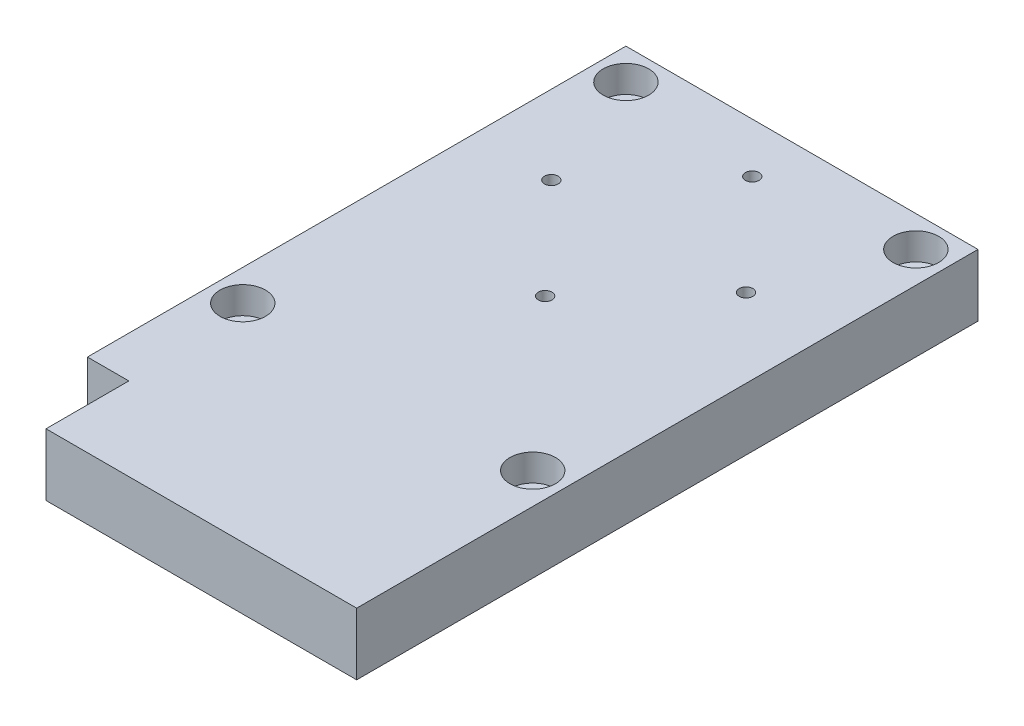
from build123d import *

# Parameters (mm, degrees)
SKETCH_1_W          = 85
SKETCH_1_H          = 15
EXTRUDE_1_DEPTH     = 150
SKETCH_2_R          = 3.25
SKETCH_2_R_2        = 1.65
SKETCH_2_W          = 10
SKETCH_2_H          = 20
CUT_EXTRUDE_1_DEPTH = 150
SKETCH_3_R          = 5.5
CUT_EXTRUDE_2_DEPTH = 6.5


with BuildPart() as part:
    # Sketch 1 → Extrude 1 (new body)
    with BuildSketch(Plane.XY):
        with Locations((42.5, 7.5)):
            Rectangle(SKETCH_1_W, SKETCH_1_H)
    extrude(amount=EXTRUDE_1_DEPTH)

    # Sketch 2 → Cut-Extrude 1 (cut)
    with BuildSketch(Plane(origin=(0, 15, 0), x_dir=(1, 0, 0), z_dir=(0, 1, 0))):
        with Locations(Location((7.5, -7.5, 0), (0, 0, 270))):
            Circle(SKETCH_2_R)
        with Locations(Location((77.5, -7.5, 0), (0, 0, 270))):
            Circle(SKETCH_2_R)
        with Locations(Location((77.5, -100, 0), (0, 0, 270))):
            Circle(SKETCH_2_R)
        with Locations(Location((7.5, -100, 0), (0, 0, 270))):
            Circle(SKETCH_2_R)
        with Locations(Location((19, -37, 0), (0, 0, 270))):
            Circle(SKETCH_2_R_2)
        with Locations(Location((66, -37, 0), (0, 0, 270))):
            Circle(SKETCH_2_R_2)
        with Locations(Location((42.5, -62, 0), (0, 0, 270))):
            Circle(SKETCH_2_R_2)
        with Locations(Location((42.5, -12, 0), (0, 0, 270))):
            Circle(SKETCH_2_R_2)
        with Locations((5, -140)):
            Rectangle(SKETCH_2_W, SKETCH_2_H)
    extrude(amount=-CUT_EXTRUDE_1_DEPTH, mode=Mode.SUBTRACT)

    # Sketch 3 → Cut-Extrude 2 (cut)
    with BuildSketch(Plane(origin=(0, 15, 0), x_dir=(1, 0, 0), z_dir=(0, 1, 0))):
        with Locations(Location((7.5, -7.5, 0), (0, 0, 270))):
            Circle(SKETCH_3_R)
        with Locations(Location((77.5, -7.5, 0), (0, 0, 270))):
            Circle(SKETCH_3_R)
        with Locations(Location((77.5, -100, 0), (0, 0, 270))):
            Circle(SKETCH_3_R)
        with Locations(Location((7.5, -100, 0), (0, 0, 270))):
            Circle(SKETCH_3_R)
    extrude(amount=-CUT_EXTRUDE_2_DEPTH, mode=Mode.SUBTRACT)


solid = part.part
